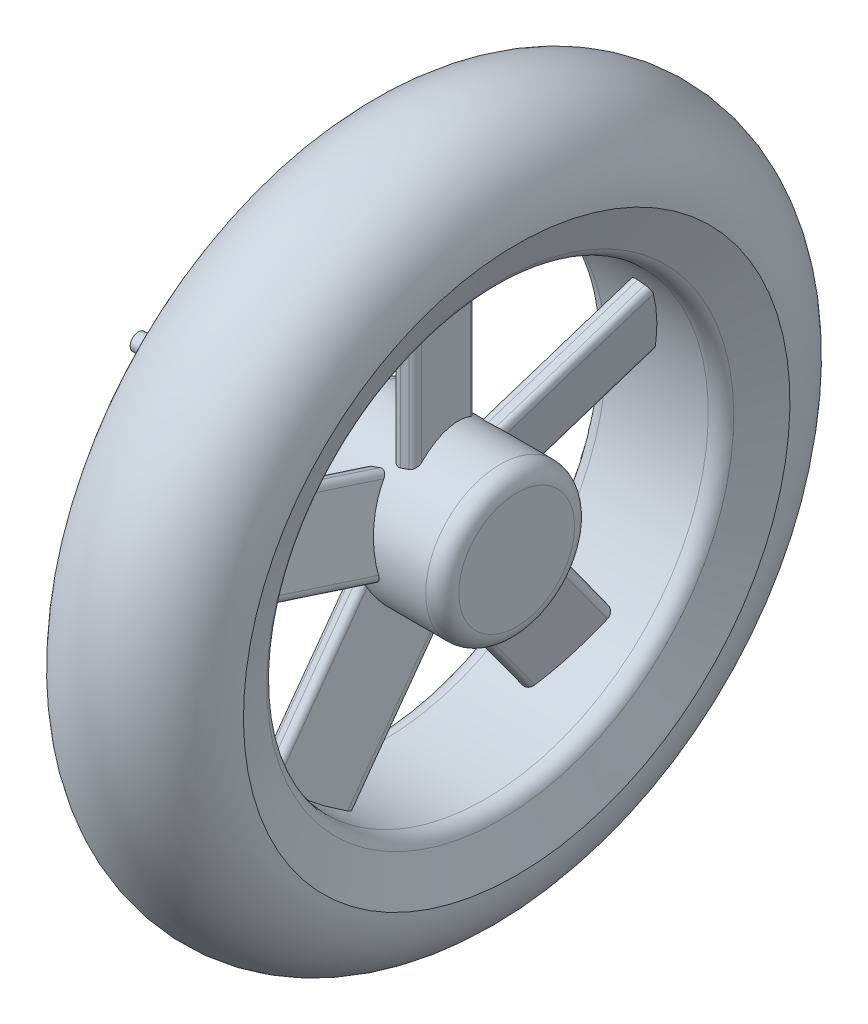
from build123d import *

# Parameters (mm, degrees)
EXTRUSION1_REACH             = 371.908
EXTRUSION1_END_RADIUS        = 135
R_P_TITION_CIRCULAIRE1_COUNT = 5
ESQUISSE4_W                  = 18
ESQUISSE4_H                  = 36.8


with BuildPart() as part:
    # Esquisse1 → R_volution1 (revolve)
    with BuildSketch(Plane.XY, mode=Mode.PRIVATE) as r_volution1_sk:
        with BuildLine():
            Line((8.660254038, 5), (55.039745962, 5))
            ThreePointArc((55.039745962, 5), (63.7, 10), (72.360254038, 5))
            Line((72.360254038, 5), (113.7, 5))
            Line((113.7, 5), (113.7, 35))
            ThreePointArc((113.7, 35), (116.628932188, 42.071067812), (123.7, 45))
            Line((123.7, 45), (203.7, 45))
            ThreePointArc((203.7, 45), (210.771067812, 42.071067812), (213.7, 35))
            Line((213.7, 35), (213.7, 0))
            Line((213.7, 0), (-15, 0))
            Line((-15, 0), (-15, 5))
            Line((-15, 5), (-8.660254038, 5))
            ThreePointArc((-8.660254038, 5), (0, 10), (8.660254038, 5))
        make_face()
    revolve(r_volution1_sk.sketch.rotate(Axis((0, 0, 0), (1, 0, 0)), 90), axis=Axis((0, 0, 0), (1, 0, 0)))



with BuildPart() as body_2:
    # Esquisse2 → R_volution2 (revolve)
    with BuildSketch(Plane.XY, mode=Mode.PRIVATE) as r_volution2_sk:
        with BuildLine():
            Line((213.7, 165.17766953), (203.757008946, 141.173165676))
            ThreePointArc((203.757008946, 141.173165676), (200.073915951, 136.685303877), (194.518213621, 135))
            Line((194.518213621, 135), (132.881786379, 135))
            ThreePointArc((132.881786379, 135), (127.326084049, 136.685303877), (123.642991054, 141.173165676))
            Line((123.642991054, 141.173165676), (113.7, 165.17766953))
            ThreePointArc((113.7, 165.17766953), (163.7, 213.5), (213.7, 165.17766953))
        make_face()
    revolve(r_volution2_sk.sketch.rotate(Axis((0, 0, 0), (1, 0, 0)), 180), axis=Axis((0, 0, 0), (1, 0, 0)))


with BuildPart() as part_1:
    add(part.part)

    add(body_2.part)  # Extrusion1 merges body 2
    # Extrusion1: up to this cylinder (the profile starts inside it)
    extrusion1_end = Plane(origin=(163.7, 0, 0), z_dir=(-1, 0, 0)) * Cylinder(EXTRUSION1_END_RADIUS, 1014.816, mode=Mode.PRIVATE)
    # Esquisse3 → Extrusion1 (add, up to the surface)
    with BuildSketch(Plane(origin=(0, 0, 0), x_dir=(1, 0, 0), z_dir=(0, 1, 0)), mode=Mode.PRIVATE) as extrusion1_sk1:
        with BuildLine():
            Line((152.469245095, 18.731528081), (163.339644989, -21.837356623))
            ThreePointArc((163.339644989, -21.837356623), (165.203348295, -24.266182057), (168.238624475, -24.665783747))
            Line((168.238624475, -24.665783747), (172.10232778, -23.630507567))
            ThreePointArc((172.10232778, -23.630507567), (174.531153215, -21.766804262), (174.930754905, -18.731528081))
            Line((174.930754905, -18.731528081), (164.060355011, 21.837356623))
            ThreePointArc((164.060355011, 21.837356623), (162.196651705, 24.266182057), (159.161375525, 24.665783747))
            Line((159.161375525, 24.665783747), (155.29767222, 23.630507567))
            ThreePointArc((155.29767222, 23.630507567), (152.868846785, 21.766804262), (152.469245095, 18.731528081))
        make_face()
    extrusion1_tool1 = extrude(extrusion1_sk1.sketch, amount=EXTRUSION1_REACH, mode=Mode.PRIVATE) & extrusion1_end
    extrusion1 = extrusion1_tool1.solids().sort_by_distance((163.7, 0, 0))[0]
    add(extrusion1)

    # R_p_tition circulaire1: Extrusion1 ×5 about axis
    r_p_tition_circulaire1_axis = Axis((0, 0, 0), (1, 0, 0))
    for i in range(1, R_P_TITION_CIRCULAIRE1_COUNT):
        add(extrusion1.rotate(r_p_tition_circulaire1_axis, i * 360 / R_P_TITION_CIRCULAIRE1_COUNT))

    # Esquisse4 → Cylindre Primitif (revolve)
    with BuildSketch(Plane.XY, mode=Mode.PRIVATE) as cylindre_primitif_sk:
        with Locations((27.5, 18.4)):
            Rectangle(ESQUISSE4_W, ESQUISSE4_H)
    revolve(cylindre_primitif_sk.sketch.rotate(Axis((0, 0, 0), (1, 0, 0)), 90), axis=Axis((0, 0, 0), (1, 0, 0)))


solid = part_1.part
